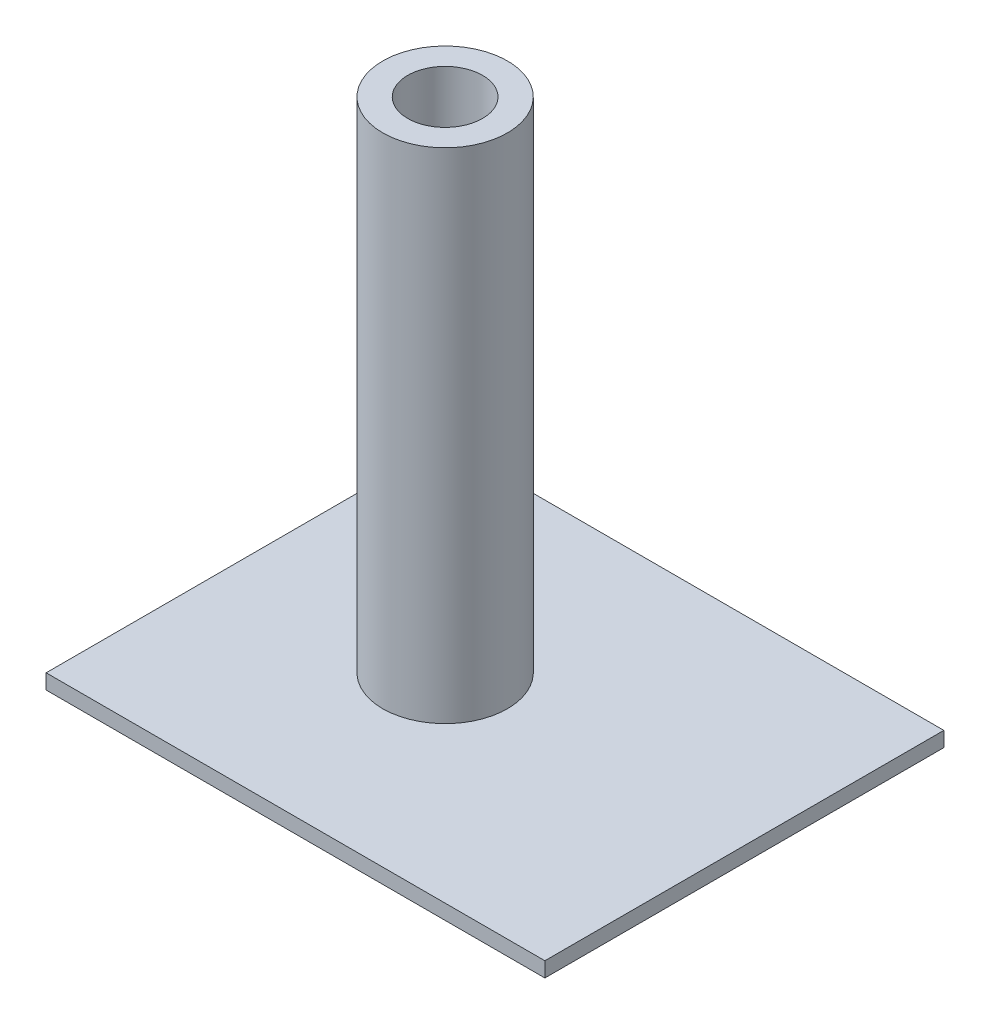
from build123d import *

# Parameters (mm, degrees)
SKETCH1_W           = 100
SKETCH1_H           = 80
BOSS_EXTRUDE1_DEPTH = 3
SKETCH2_R           = 12.5
SKETCH2_R_2         = 7.5
EXTRUDE_THIN1_DEPTH = 100


with BuildPart() as part:
    # Sketch1 → Boss-Extrude1 (new body)
    with BuildSketch(Plane(origin=(0, 0, 0), x_dir=(1, 0, 0), z_dir=(0, 1, 0))):
        Rectangle(SKETCH1_W, SKETCH1_H)
    extrude(amount=-BOSS_EXTRUDE1_DEPTH)

    # Sketch2 → Extrude-Thin1 (add)
    with BuildSketch(Plane(origin=(0, 0, 0), x_dir=(1, 0, 0), z_dir=(0, 1, 0))):
        with Locations((-10, 0)):
            Circle(SKETCH2_R)
        with Locations((-10, 0)):
            Circle(SKETCH2_R_2, mode=Mode.SUBTRACT)
    extrude(amount=EXTRUDE_THIN1_DEPTH)


solid = part.part
